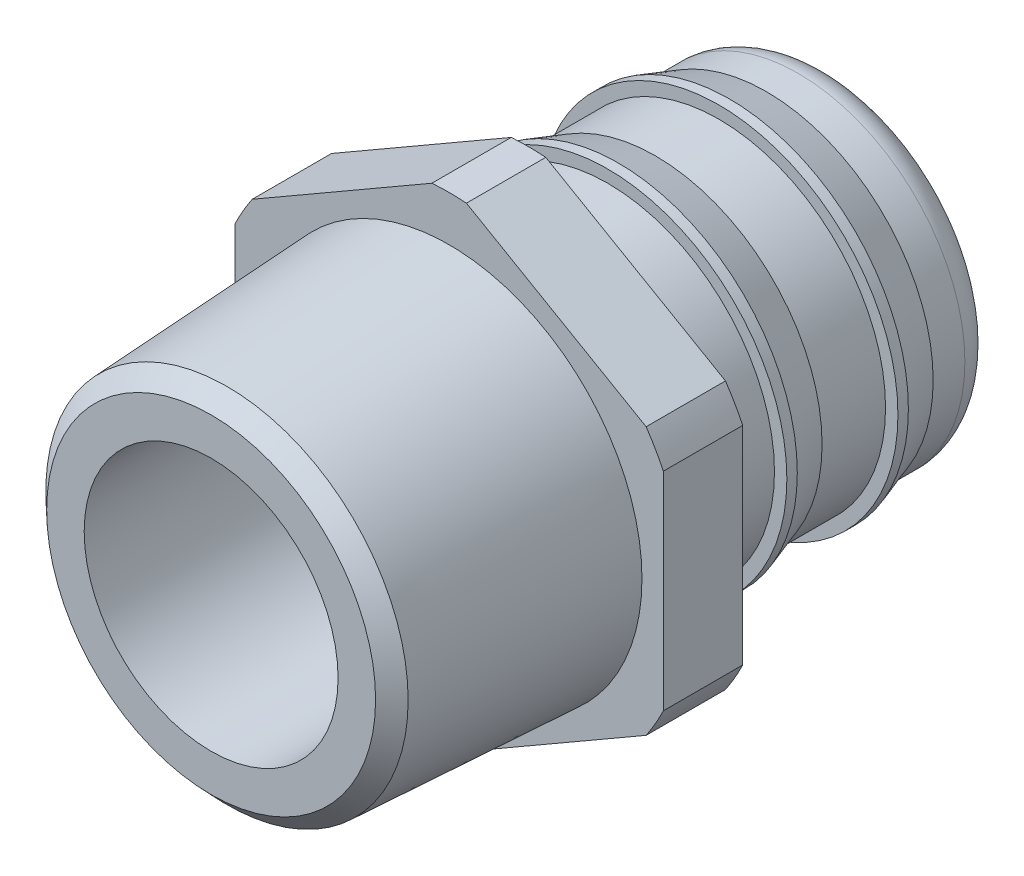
ISO-10303-21;
HEADER;
FILE_DESCRIPTION(('STEP AP214'),'2;1');
FILE_NAME('part.step','',(''),(''),'','','');
FILE_SCHEMA(('AUTOMOTIVE_DESIGN { 1 0 10303 214 1 1 1 1 }'));
ENDSEC;
DATA;
#1=APPLICATION_CONTEXT('core data for automotive mechanical design processes');
#2=APPLICATION_PROTOCOL_DEFINITION('international standard','automotive_design',2000,#1);
#3=PRODUCT_CONTEXT('',#1,'mechanical');
#4=PRODUCT('Part','Part','',(#3));
#5=PRODUCT_RELATED_PRODUCT_CATEGORY('part','',(#4));
#6=PRODUCT_DEFINITION_FORMATION('','',#4);
#7=PRODUCT_DEFINITION_CONTEXT('part definition',#1,'design');
#8=PRODUCT_DEFINITION('design','',#6,#7);
#9=PRODUCT_DEFINITION_SHAPE('','',#8);
#10=(LENGTH_UNIT() NAMED_UNIT(*) SI_UNIT(.MILLI.,.METRE.));
#11=(NAMED_UNIT(*) PLANE_ANGLE_UNIT() SI_UNIT($,.RADIAN.));
#12=(NAMED_UNIT(*) SI_UNIT($,.STERADIAN.) SOLID_ANGLE_UNIT());
#13=UNCERTAINTY_MEASURE_WITH_UNIT(LENGTH_MEASURE(1.E-05),#10,'distance_accuracy_value','');
#14=(GEOMETRIC_REPRESENTATION_CONTEXT(3) GLOBAL_UNCERTAINTY_ASSIGNED_CONTEXT((#13)) GLOBAL_UNIT_ASSIGNED_CONTEXT((#10,
#11,#12)) REPRESENTATION_CONTEXT('',''));
#15=CARTESIAN_POINT('',(0.,0.,0.));
#16=DIRECTION('',(0.,0.,1.));
#17=DIRECTION('',(1.,0.,0.));
#18=AXIS2_PLACEMENT_3D('',#15,#16,#17);
#19=CARTESIAN_POINT('',(0.,0.,0.));
#20=DIRECTION('',(0.,0.,1.));
#21=DIRECTION('',(1.,0.,0.));
#22=AXIS2_PLACEMENT_3D('',#19,#20,#21);
#23=CYLINDRICAL_SURFACE('',#22,15.);
#24=CARTESIAN_POINT('',(0.,0.,-30.));
#25=DIRECTION('',(0.,0.,1.));
#26=DIRECTION('',(1.,0.,0.));
#27=AXIS2_PLACEMENT_3D('',#24,#25,#26);
#28=CIRCLE('',#27,15.);
#29=CARTESIAN_POINT('',(-12.4123758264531,8.42216874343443,-30.));
#30=VERTEX_POINT('',#29);
#31=CARTESIAN_POINT('',(-13.5,6.53834841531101,-30.));
#32=VERTEX_POINT('',#31);
#33=EDGE_CURVE('E133',#30,#32,#28,.T.);
#34=ORIENTED_EDGE('',*,*,#33,.T.);
#35=DIRECTION('',(0.,0.,-1.));
#36=VECTOR('',#35,1.);
#37=CARTESIAN_POINT('',(-13.5,6.53834841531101,-10.));
#38=LINE('',#37,#36);
#39=CARTESIAN_POINT('',(-13.5,6.53834841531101,-25.));
#40=VERTEX_POINT('',#39);
#41=EDGE_CURVE('E118',#40,#32,#38,.T.);
#42=ORIENTED_EDGE('',*,*,#41,.F.);
#43=CARTESIAN_POINT('',(0.,0.,-25.));
#44=DIRECTION('',(0.,0.,1.));
#45=DIRECTION('',(1.,0.,0.));
#46=AXIS2_PLACEMENT_3D('',#43,#44,#45);
#47=CIRCLE('',#46,15.);
#48=CARTESIAN_POINT('',(-12.4123758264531,8.42216874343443,-25.));
#49=VERTEX_POINT('',#48);
#50=EDGE_CURVE('E155',#49,#40,#47,.T.);
#51=ORIENTED_EDGE('',*,*,#50,.F.);
#52=DIRECTION('',(0.,0.,-1.));
#53=VECTOR('',#52,1.);
#54=CARTESIAN_POINT('',(-12.4123758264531,8.42216874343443,-10.));
#55=LINE('',#54,#53);
#56=EDGE_CURVE('E138',#49,#30,#55,.T.);
#57=ORIENTED_EDGE('',*,*,#56,.T.);
#58=EDGE_LOOP('',(#34,#42,#51,#57));
#59=FACE_BOUND('',#58,.T.);
#60=ADVANCED_FACE('F31',(#59),#23,.T.);
#61=CARTESIAN_POINT('',(-13.5,-6.53834841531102,-25.));
#62=VERTEX_POINT('',#61);
#63=CARTESIAN_POINT('',(-12.4123758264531,-8.42216874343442,-25.));
#64=VERTEX_POINT('',#63);
#65=EDGE_CURVE('E156',#62,#64,#47,.T.);
#66=ORIENTED_EDGE('',*,*,#65,.F.);
#67=DIRECTION('',(0.,0.,-1.));
#68=VECTOR('',#67,1.);
#69=CARTESIAN_POINT('',(-13.5,-6.53834841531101,-10.));
#70=LINE('',#69,#68);
#71=CARTESIAN_POINT('',(-13.5,-6.53834841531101,-30.));
#72=VERTEX_POINT('',#71);
#73=EDGE_CURVE('E46',#62,#72,#70,.T.);
#74=ORIENTED_EDGE('',*,*,#73,.T.);
#75=CARTESIAN_POINT('',(-12.4123758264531,-8.42216874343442,-30.));
#76=VERTEX_POINT('',#75);
#77=EDGE_CURVE('E135',#72,#76,#28,.T.);
#78=ORIENTED_EDGE('',*,*,#77,.T.);
#79=DIRECTION('',(0.,0.,-1.));
#80=VECTOR('',#79,1.);
#81=CARTESIAN_POINT('',(-12.4123758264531,-8.42216874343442,-10.));
#82=LINE('',#81,#80);
#83=EDGE_CURVE('E215',#64,#76,#82,.T.);
#84=ORIENTED_EDGE('',*,*,#83,.F.);
#85=EDGE_LOOP('',(#66,#74,#78,#84));
#86=FACE_BOUND('',#85,.T.);
#87=ADVANCED_FACE('F222',(#86),#23,.T.);
#88=CARTESIAN_POINT('',(-1.08762417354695,-14.9605171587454,-25.));
#89=VERTEX_POINT('',#88);
#90=CARTESIAN_POINT('',(1.08762417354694,-14.9605171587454,-25.));
#91=VERTEX_POINT('',#90);
#92=EDGE_CURVE('E163',#89,#91,#47,.T.);
#93=ORIENTED_EDGE('',*,*,#92,.F.);
#94=DIRECTION('',(0.,0.,-1.));
#95=VECTOR('',#94,1.);
#96=CARTESIAN_POINT('',(-1.08762417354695,-14.9605171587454,-10.));
#97=LINE('',#96,#95);
#98=CARTESIAN_POINT('',(-1.08762417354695,-14.9605171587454,-30.));
#99=VERTEX_POINT('',#98);
#100=EDGE_CURVE('E53',#89,#99,#97,.T.);
#101=ORIENTED_EDGE('',*,*,#100,.T.);
#102=CARTESIAN_POINT('',(1.08762417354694,-14.9605171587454,-30.));
#103=VERTEX_POINT('',#102);
#104=EDGE_CURVE('E144',#99,#103,#28,.T.);
#105=ORIENTED_EDGE('',*,*,#104,.T.);
#106=DIRECTION('',(0.,0.,-1.));
#107=VECTOR('',#106,1.);
#108=CARTESIAN_POINT('',(1.08762417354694,-14.9605171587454,-10.));
#109=LINE('',#108,#107);
#110=EDGE_CURVE('E208',#91,#103,#109,.T.);
#111=ORIENTED_EDGE('',*,*,#110,.F.);
#112=EDGE_LOOP('',(#93,#101,#105,#111));
#113=FACE_BOUND('',#112,.T.);
#114=ADVANCED_FACE('F230',(#113),#23,.T.);
#115=CARTESIAN_POINT('',(12.4123758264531,-8.42216874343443,-25.));
#116=VERTEX_POINT('',#115);
#117=CARTESIAN_POINT('',(13.5,-6.53834841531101,-25.));
#118=VERTEX_POINT('',#117);
#119=EDGE_CURVE('E165',#116,#118,#47,.T.);
#120=ORIENTED_EDGE('',*,*,#119,.F.);
#121=DIRECTION('',(0.,0.,-1.));
#122=VECTOR('',#121,1.);
#123=CARTESIAN_POINT('',(12.4123758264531,-8.42216874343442,-10.));
#124=LINE('',#123,#122);
#125=CARTESIAN_POINT('',(12.4123758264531,-8.42216874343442,-30.));
#126=VERTEX_POINT('',#125);
#127=EDGE_CURVE('E207',#116,#126,#124,.T.);
#128=ORIENTED_EDGE('',*,*,#127,.T.);
#129=CARTESIAN_POINT('',(13.5,-6.53834841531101,-30.));
#130=VERTEX_POINT('',#129);
#131=EDGE_CURVE('E147',#126,#130,#28,.T.);
#132=ORIENTED_EDGE('',*,*,#131,.T.);
#133=DIRECTION('',(0.,0.,-1.));
#134=VECTOR('',#133,1.);
#135=CARTESIAN_POINT('',(13.5,-6.53834841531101,-10.));
#136=LINE('',#135,#134);
#137=EDGE_CURVE('E201',#118,#130,#136,.T.);
#138=ORIENTED_EDGE('',*,*,#137,.F.);
#139=EDGE_LOOP('',(#120,#128,#132,#138));
#140=FACE_BOUND('',#139,.T.);
#141=ADVANCED_FACE('F381',(#140),#23,.T.);
#142=CARTESIAN_POINT('',(1.08762417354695,14.9605171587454,-30.));
#143=VERTEX_POINT('',#142);
#144=CARTESIAN_POINT('',(-1.08762417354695,14.9605171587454,-30.));
#145=VERTEX_POINT('',#144);
#146=EDGE_CURVE('E139',#143,#145,#28,.T.);
#147=ORIENTED_EDGE('',*,*,#146,.T.);
#148=DIRECTION('',(0.,0.,-1.));
#149=VECTOR('',#148,1.);
#150=CARTESIAN_POINT('',(-1.08762417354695,14.9605171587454,-10.));
#151=LINE('',#150,#149);
#152=CARTESIAN_POINT('',(-1.08762417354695,14.9605171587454,-25.));
#153=VERTEX_POINT('',#152);
#154=EDGE_CURVE('E195',#153,#145,#151,.T.);
#155=ORIENTED_EDGE('',*,*,#154,.F.);
#156=CARTESIAN_POINT('',(1.08762417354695,14.9605171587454,-25.));
#157=VERTEX_POINT('',#156);
#158=EDGE_CURVE('E148',#157,#153,#47,.T.);
#159=ORIENTED_EDGE('',*,*,#158,.F.);
#160=DIRECTION('',(0.,0.,-1.));
#161=VECTOR('',#160,1.);
#162=CARTESIAN_POINT('',(1.08762417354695,14.9605171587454,-10.));
#163=LINE('',#162,#161);
#164=EDGE_CURVE('E188',#157,#143,#163,.T.);
#165=ORIENTED_EDGE('',*,*,#164,.T.);
#166=EDGE_LOOP('',(#147,#155,#159,#165));
#167=FACE_BOUND('',#166,.T.);
#168=ADVANCED_FACE('F344',(#167),#23,.T.);
#169=CARTESIAN_POINT('',(0.,0.,0.));
#170=DIRECTION('',(0.,0.,1.));
#171=DIRECTION('',(1.,0.,0.));
#172=AXIS2_PLACEMENT_3D('',#169,#170,#171);
#173=CYLINDRICAL_SURFACE('',#172,8.);
#174=CARTESIAN_POINT('',(0.,0.,-49.));
#175=DIRECTION('',(0.,0.,1.));
#176=DIRECTION('',(1.,0.,0.));
#177=AXIS2_PLACEMENT_3D('',#174,#175,#176);
#178=CIRCLE('',#177,8.);
#179=CARTESIAN_POINT('',(8.,0.,-49.));
#180=VERTEX_POINT('',#179);
#181=EDGE_CURVE('E242',#180,#180,#178,.T.);
#182=ORIENTED_EDGE('',*,*,#181,.F.);
#183=EDGE_LOOP('',(#182));
#184=FACE_BOUND('',#183,.T.);
#185=CARTESIAN_POINT('',(0.,0.,-10.));
#186=DIRECTION('',(0.,0.,1.));
#187=DIRECTION('',(1.,0.,0.));
#188=AXIS2_PLACEMENT_3D('',#185,#186,#187);
#189=CIRCLE('',#188,8.);
#190=CARTESIAN_POINT('',(8.,0.,-10.));
#191=VERTEX_POINT('',#190);
#192=EDGE_CURVE('E185',#191,#191,#189,.T.);
#193=ORIENTED_EDGE('',*,*,#192,.T.);
#194=EDGE_LOOP('',(#193));
#195=FACE_BOUND('',#194,.T.);
#196=ADVANCED_FACE('F33',(#184,#195),#173,.F.);
#197=CARTESIAN_POINT('',(0.,8.49999999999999,-49.));
#198=DIRECTION('',(0.,0.,1.));
#199=DIRECTION('',(1.,0.,0.));
#200=AXIS2_PLACEMENT_3D('',#197,#198,#199);
#201=PLANE('',#200);
#202=CARTESIAN_POINT('',(0.,0.,-49.));
#203=DIRECTION('',(0.,0.,1.));
#204=DIRECTION('',(1.,0.,0.));
#205=AXIS2_PLACEMENT_3D('',#202,#203,#204);
#206=CIRCLE('',#205,8.49999999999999);
#207=CARTESIAN_POINT('',(8.49999999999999,0.,-49.));
#208=VERTEX_POINT('',#207);
#209=EDGE_CURVE('E245',#208,#208,#206,.T.);
#210=ORIENTED_EDGE('',*,*,#209,.F.);
#211=EDGE_LOOP('',(#210));
#212=FACE_BOUND('',#211,.T.);
#213=ORIENTED_EDGE('',*,*,#181,.T.);
#214=EDGE_LOOP('',(#213));
#215=FACE_BOUND('',#214,.T.);
#216=ADVANCED_FACE('F334',(#212,#215),#201,.F.);
#217=CARTESIAN_POINT('',(0.,0.,-47.));
#218=DIRECTION('',(0.,0.,1.));
#219=DIRECTION('',(1.,0.,0.));
#220=AXIS2_PLACEMENT_3D('',#217,#218,#219);
#221=TOROIDAL_SURFACE('',#220,8.5,2.);
#222=CARTESIAN_POINT('',(0.,0.,-47.));
#223=DIRECTION('',(0.,0.,1.));
#224=DIRECTION('',(1.,0.,0.));
#225=AXIS2_PLACEMENT_3D('',#222,#223,#224);
#226=CIRCLE('',#225,10.5);
#227=CARTESIAN_POINT('',(10.5,0.,-47.));
#228=VERTEX_POINT('',#227);
#229=EDGE_CURVE('E248',#228,#228,#226,.T.);
#230=ORIENTED_EDGE('',*,*,#229,.F.);
#231=EDGE_LOOP('',(#230));
#232=FACE_BOUND('',#231,.T.);
#233=ORIENTED_EDGE('',*,*,#209,.T.);
#234=EDGE_LOOP('',(#233));
#235=FACE_BOUND('',#234,.T.);
#236=ADVANCED_FACE('F328',(#232,#235),#221,.T.);
#237=CARTESIAN_POINT('',(0.,0.,0.));
#238=DIRECTION('',(0.,0.,1.));
#239=DIRECTION('',(1.,0.,0.));
#240=AXIS2_PLACEMENT_3D('',#237,#238,#239);
#241=CYLINDRICAL_SURFACE('',#240,10.5);
#242=CARTESIAN_POINT('',(0.,0.,-45.00000000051));
#243=DIRECTION('',(0.,0.,1.));
#244=DIRECTION('',(1.,0.,0.));
#245=AXIS2_PLACEMENT_3D('',#242,#243,#244);
#246=CIRCLE('',#245,10.5);
#247=CARTESIAN_POINT('',(10.5,0.,-45.00000000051));
#248=VERTEX_POINT('',#247);
#249=EDGE_CURVE('E251',#248,#248,#246,.T.);
#250=ORIENTED_EDGE('',*,*,#249,.F.);
#251=EDGE_LOOP('',(#250));
#252=FACE_BOUND('',#251,.T.);
#253=ORIENTED_EDGE('',*,*,#229,.T.);
#254=EDGE_LOOP('',(#253));
#255=FACE_BOUND('',#254,.T.);
#256=ADVANCED_FACE('F322',(#252,#255),#241,.T.);
#257=CARTESIAN_POINT('',(0.,0.,-45.00000000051));
#258=DIRECTION('',(0.,0.,1.));
#259=DIRECTION('',(1.,0.,0.));
#260=AXIS2_PLACEMENT_3D('',#257,#258,#259);
#261=CONICAL_SURFACE('',#260,10.5,0.32175055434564);
#262=CARTESIAN_POINT('',(0.,0.,-42.6581138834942));
#263=DIRECTION('',(0.,0.,1.));
#264=DIRECTION('',(1.,0.,0.));
#265=AXIS2_PLACEMENT_3D('',#262,#263,#264);
#266=CIRCLE('',#265,11.2806287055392);
#267=CARTESIAN_POINT('',(11.2806287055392,0.,-42.6581138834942));
#268=VERTEX_POINT('',#267);
#269=EDGE_CURVE('E254',#268,#268,#266,.T.);
#270=ORIENTED_EDGE('',*,*,#269,.F.);
#271=EDGE_LOOP('',(#270));
#272=FACE_BOUND('',#271,.T.);
#273=ORIENTED_EDGE('',*,*,#249,.T.);
#274=EDGE_LOOP('',(#273));
#275=FACE_BOUND('',#274,.T.);
#276=ADVANCED_FACE('F316',(#272,#275),#261,.T.);
#277=CARTESIAN_POINT('',(0.,0.,0.));
#278=DIRECTION('',(0.,0.,1.));
#279=DIRECTION('',(1.,0.,0.));
#280=AXIS2_PLACEMENT_3D('',#277,#278,#279);
#281=CYLINDRICAL_SURFACE('',#280,11.2806287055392);
#282=CARTESIAN_POINT('',(0.,0.,-42.));
#283=DIRECTION('',(0.,0.,1.));
#284=DIRECTION('',(1.,0.,0.));
#285=AXIS2_PLACEMENT_3D('',#282,#283,#284);
#286=CIRCLE('',#285,11.2806287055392);
#287=CARTESIAN_POINT('',(11.2806287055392,0.,-42.));
#288=VERTEX_POINT('',#287);
#289=EDGE_CURVE('E257',#288,#288,#286,.T.);
#290=ORIENTED_EDGE('',*,*,#289,.F.);
#291=EDGE_LOOP('',(#290));
#292=FACE_BOUND('',#291,.T.);
#293=ORIENTED_EDGE('',*,*,#269,.T.);
#294=EDGE_LOOP('',(#293));
#295=FACE_BOUND('',#294,.T.);
#296=ADVANCED_FACE('F310',(#292,#295),#281,.T.);
#297=CARTESIAN_POINT('',(0.,10.5,-42.));
#298=DIRECTION('',(0.,0.,-1.));
#299=DIRECTION('',(-1.,0.,0.));
#300=AXIS2_PLACEMENT_3D('',#297,#298,#299);
#301=PLANE('',#300);
#302=CARTESIAN_POINT('',(0.,0.,-42.));
#303=DIRECTION('',(0.,0.,1.));
#304=DIRECTION('',(1.,0.,0.));
#305=AXIS2_PLACEMENT_3D('',#302,#303,#304);
#306=CIRCLE('',#305,10.5);
#307=CARTESIAN_POINT('',(10.5,0.,-42.));
#308=VERTEX_POINT('',#307);
#309=EDGE_CURVE('E260',#308,#308,#306,.T.);
#310=ORIENTED_EDGE('',*,*,#309,.F.);
#311=EDGE_LOOP('',(#310));
#312=FACE_BOUND('',#311,.T.);
#313=ORIENTED_EDGE('',*,*,#289,.T.);
#314=EDGE_LOOP('',(#313));
#315=FACE_BOUND('',#314,.T.);
#316=ADVANCED_FACE('F304',(#312,#315),#301,.F.);
#317=CARTESIAN_POINT('',(0.,0.,0.));
#318=DIRECTION('',(0.,0.,1.));
#319=DIRECTION('',(1.,0.,0.));
#320=AXIS2_PLACEMENT_3D('',#317,#318,#319);
#321=CYLINDRICAL_SURFACE('',#320,10.5);
#322=CARTESIAN_POINT('',(0.,0.,-38.));
#323=DIRECTION('',(0.,0.,1.));
#324=DIRECTION('',(1.,0.,0.));
#325=AXIS2_PLACEMENT_3D('',#322,#323,#324);
#326=CIRCLE('',#325,10.5);
#327=CARTESIAN_POINT('',(10.5,0.,-38.));
#328=VERTEX_POINT('',#327);
#329=EDGE_CURVE('E263',#328,#328,#326,.T.);
#330=ORIENTED_EDGE('',*,*,#329,.F.);
#331=EDGE_LOOP('',(#330));
#332=FACE_BOUND('',#331,.T.);
#333=ORIENTED_EDGE('',*,*,#309,.T.);
#334=EDGE_LOOP('',(#333));
#335=FACE_BOUND('',#334,.T.);
#336=ADVANCED_FACE('F298',(#332,#335),#321,.T.);
#337=CARTESIAN_POINT('',(0.,0.,-38.));
#338=DIRECTION('',(0.,0.,1.));
#339=DIRECTION('',(1.,0.,0.));
#340=AXIS2_PLACEMENT_3D('',#337,#338,#339);
#341=CONICAL_SURFACE('',#340,10.5,0.321750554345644);
#342=CARTESIAN_POINT('',(0.,0.,-35.6581138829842));
#343=DIRECTION('',(0.,0.,1.));
#344=DIRECTION('',(1.,0.,0.));
#345=AXIS2_PLACEMENT_3D('',#342,#343,#344);
#346=CIRCLE('',#345,11.2806287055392);
#347=CARTESIAN_POINT('',(11.2806287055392,0.,-35.6581138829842));
#348=VERTEX_POINT('',#347);
#349=EDGE_CURVE('E266',#348,#348,#346,.T.);
#350=ORIENTED_EDGE('',*,*,#349,.F.);
#351=EDGE_LOOP('',(#350));
#352=FACE_BOUND('',#351,.T.);
#353=ORIENTED_EDGE('',*,*,#329,.T.);
#354=EDGE_LOOP('',(#353));
#355=FACE_BOUND('',#354,.T.);
#356=ADVANCED_FACE('F292',(#352,#355),#341,.T.);
#357=CARTESIAN_POINT('',(0.,0.,0.));
#358=DIRECTION('',(0.,0.,1.));
#359=DIRECTION('',(1.,0.,0.));
#360=AXIS2_PLACEMENT_3D('',#357,#358,#359);
#361=CYLINDRICAL_SURFACE('',#360,11.2806287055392);
#362=CARTESIAN_POINT('',(0.,0.,-35.));
#363=DIRECTION('',(0.,0.,1.));
#364=DIRECTION('',(1.,0.,0.));
#365=AXIS2_PLACEMENT_3D('',#362,#363,#364);
#366=CIRCLE('',#365,11.2806287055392);
#367=CARTESIAN_POINT('',(11.2806287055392,0.,-35.));
#368=VERTEX_POINT('',#367);
#369=EDGE_CURVE('E269',#368,#368,#366,.T.);
#370=ORIENTED_EDGE('',*,*,#369,.F.);
#371=EDGE_LOOP('',(#370));
#372=FACE_BOUND('',#371,.T.);
#373=ORIENTED_EDGE('',*,*,#349,.T.);
#374=EDGE_LOOP('',(#373));
#375=FACE_BOUND('',#374,.T.);
#376=ADVANCED_FACE('F286',(#372,#375),#361,.T.);
#377=CARTESIAN_POINT('',(0.,10.5,-35.));
#378=DIRECTION('',(0.,0.,-1.));
#379=DIRECTION('',(-1.,0.,0.));
#380=AXIS2_PLACEMENT_3D('',#377,#378,#379);
#381=PLANE('',#380);
#382=CARTESIAN_POINT('',(0.,0.,-35.));
#383=DIRECTION('',(0.,0.,1.));
#384=DIRECTION('',(1.,0.,0.));
#385=AXIS2_PLACEMENT_3D('',#382,#383,#384);
#386=CIRCLE('',#385,10.5);
#387=CARTESIAN_POINT('',(10.5,0.,-35.));
#388=VERTEX_POINT('',#387);
#389=EDGE_CURVE('E272',#388,#388,#386,.T.);
#390=ORIENTED_EDGE('',*,*,#389,.F.);
#391=EDGE_LOOP('',(#390));
#392=FACE_BOUND('',#391,.T.);
#393=ORIENTED_EDGE('',*,*,#369,.T.);
#394=EDGE_LOOP('',(#393));
#395=FACE_BOUND('',#394,.T.);
#396=ADVANCED_FACE('F280',(#392,#395),#381,.F.);
#397=CARTESIAN_POINT('',(0.,0.,0.));
#398=DIRECTION('',(0.,0.,1.));
#399=DIRECTION('',(1.,0.,0.));
#400=AXIS2_PLACEMENT_3D('',#397,#398,#399);
#401=CYLINDRICAL_SURFACE('',#400,10.5);
#402=CARTESIAN_POINT('',(0.,0.,-30.));
#403=DIRECTION('',(0.,0.,1.));
#404=DIRECTION('',(1.,0.,0.));
#405=AXIS2_PLACEMENT_3D('',#402,#403,#404);
#406=CIRCLE('',#405,10.5);
#407=CARTESIAN_POINT('',(10.5,0.,-30.));
#408=VERTEX_POINT('',#407);
#409=EDGE_CURVE('E143',#408,#408,#406,.T.);
#410=ORIENTED_EDGE('',*,*,#409,.F.);
#411=EDGE_LOOP('',(#410));
#412=FACE_BOUND('',#411,.T.);
#413=ORIENTED_EDGE('',*,*,#389,.T.);
#414=EDGE_LOOP('',(#413));
#415=FACE_BOUND('',#414,.T.);
#416=ADVANCED_FACE('F277',(#412,#415),#401,.T.);
#417=CARTESIAN_POINT('',(0.,15.,-30.));
#418=DIRECTION('',(0.,0.,1.));
#419=DIRECTION('',(1.,0.,0.));
#420=AXIS2_PLACEMENT_3D('',#417,#418,#419);
#421=PLANE('',#420);
#422=ORIENTED_EDGE('',*,*,#77,.F.);
#423=DIRECTION('',(0.,-1.,0.));
#424=VECTOR('',#423,1.);
#425=CARTESIAN_POINT('',(-13.5,-6.53834841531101,-30.));
#426=LINE('',#425,#424);
#427=EDGE_CURVE('E121',#32,#72,#426,.T.);
#428=ORIENTED_EDGE('',*,*,#427,.F.);
#429=ORIENTED_EDGE('',*,*,#33,.F.);
#430=DIRECTION('',(-0.866025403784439,-0.5,0.));
#431=VECTOR('',#430,1.);
#432=CARTESIAN_POINT('',(-12.4123758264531,8.42216874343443,-30.));
#433=LINE('',#432,#431);
#434=EDGE_CURVE('E197',#145,#30,#433,.T.);
#435=ORIENTED_EDGE('',*,*,#434,.F.);
#436=ORIENTED_EDGE('',*,*,#146,.F.);
#437=DIRECTION('',(-0.866025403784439,0.5,0.));
#438=VECTOR('',#437,1.);
#439=CARTESIAN_POINT('',(1.08762417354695,14.9605171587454,-30.));
#440=LINE('',#439,#438);
#441=CARTESIAN_POINT('',(12.4123758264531,8.42216874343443,-30.));
#442=VERTEX_POINT('',#441);
#443=EDGE_CURVE('E191',#442,#143,#440,.T.);
#444=ORIENTED_EDGE('',*,*,#443,.F.);
#445=CARTESIAN_POINT('',(13.5,6.53834841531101,-30.));
#446=VERTEX_POINT('',#445);
#447=EDGE_CURVE('E141',#446,#442,#28,.T.);
#448=ORIENTED_EDGE('',*,*,#447,.F.);
#449=DIRECTION('',(0.,1.,0.));
#450=VECTOR('',#449,1.);
#451=CARTESIAN_POINT('',(13.5,6.53834841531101,-30.));
#452=LINE('',#451,#450);
#453=EDGE_CURVE('E204',#130,#446,#452,.T.);
#454=ORIENTED_EDGE('',*,*,#453,.F.);
#455=ORIENTED_EDGE('',*,*,#131,.F.);
#456=DIRECTION('',(0.866025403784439,0.5,0.));
#457=VECTOR('',#456,1.);
#458=CARTESIAN_POINT('',(12.4123758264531,-8.42216874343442,-30.));
#459=LINE('',#458,#457);
#460=EDGE_CURVE('E211',#103,#126,#459,.T.);
#461=ORIENTED_EDGE('',*,*,#460,.F.);
#462=ORIENTED_EDGE('',*,*,#104,.F.);
#463=DIRECTION('',(0.866025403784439,-0.5,0.));
#464=VECTOR('',#463,1.);
#465=CARTESIAN_POINT('',(-1.08762417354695,-14.9605171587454,-30.));
#466=LINE('',#465,#464);
#467=EDGE_CURVE('E218',#76,#99,#466,.T.);
#468=ORIENTED_EDGE('',*,*,#467,.F.);
#469=EDGE_LOOP('',(#422,#428,#429,#435,#436,#444,#448,#454,#455,#461,#462,#468));
#470=FACE_BOUND('',#469,.T.);
#471=ORIENTED_EDGE('',*,*,#409,.T.);
#472=EDGE_LOOP('',(#471));
#473=FACE_BOUND('',#472,.T.);
#474=ADVANCED_FACE('F130',(#470,#473),#421,.F.);
#475=CARTESIAN_POINT('',(13.5,6.53834841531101,-25.));
#476=VERTEX_POINT('',#475);
#477=CARTESIAN_POINT('',(12.4123758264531,8.42216874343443,-25.));
#478=VERTEX_POINT('',#477);
#479=EDGE_CURVE('E161',#476,#478,#47,.T.);
#480=ORIENTED_EDGE('',*,*,#479,.F.);
#481=DIRECTION('',(0.,0.,-1.));
#482=VECTOR('',#481,1.);
#483=CARTESIAN_POINT('',(13.5,6.53834841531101,-10.));
#484=LINE('',#483,#482);
#485=EDGE_CURVE('E200',#476,#446,#484,.T.);
#486=ORIENTED_EDGE('',*,*,#485,.T.);
#487=ORIENTED_EDGE('',*,*,#447,.T.);
#488=DIRECTION('',(0.,0.,-1.));
#489=VECTOR('',#488,1.);
#490=CARTESIAN_POINT('',(12.4123758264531,8.42216874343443,-10.));
#491=LINE('',#490,#489);
#492=EDGE_CURVE('E189',#478,#442,#491,.T.);
#493=ORIENTED_EDGE('',*,*,#492,.F.);
#494=EDGE_LOOP('',(#480,#486,#487,#493));
#495=FACE_BOUND('',#494,.T.);
#496=ADVANCED_FACE('F367',(#495),#23,.T.);
#497=CARTESIAN_POINT('',(0.,12.15,-25.));
#498=DIRECTION('',(0.,0.,-1.));
#499=DIRECTION('',(-1.,0.,0.));
#500=AXIS2_PLACEMENT_3D('',#497,#498,#499);
#501=PLANE('',#500);
#502=CARTESIAN_POINT('',(0.,0.,-25.));
#503=DIRECTION('',(0.,0.,1.));
#504=DIRECTION('',(1.,0.,0.));
#505=AXIS2_PLACEMENT_3D('',#502,#503,#504);
#506=CIRCLE('',#505,12.15);
#507=CARTESIAN_POINT('',(12.15,0.,-25.));
#508=VERTEX_POINT('',#507);
#509=EDGE_CURVE('E172',#508,#508,#506,.T.);
#510=ORIENTED_EDGE('',*,*,#509,.F.);
#511=EDGE_LOOP('',(#510));
#512=FACE_BOUND('',#511,.T.);
#513=ORIENTED_EDGE('',*,*,#50,.T.);
#514=DIRECTION('',(0.,-1.,0.));
#515=VECTOR('',#514,1.);
#516=CARTESIAN_POINT('',(-13.5,12.15,-25.));
#517=LINE('',#516,#515);
#518=EDGE_CURVE('E11',#40,#62,#517,.T.);
#519=ORIENTED_EDGE('',*,*,#518,.T.);
#520=ORIENTED_EDGE('',*,*,#65,.T.);
#521=DIRECTION('',(0.866025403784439,-0.5,0.));
#522=VECTOR('',#521,1.);
#523=CARTESIAN_POINT('',(-12.0111043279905,-8.65384295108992,-25.));
#524=LINE('',#523,#522);
#525=EDGE_CURVE('E39',#64,#89,#524,.T.);
#526=ORIENTED_EDGE('',*,*,#525,.T.);
#527=ORIENTED_EDGE('',*,*,#92,.T.);
#528=DIRECTION('',(0.866025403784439,0.5,0.));
#529=VECTOR('',#528,1.);
#530=CARTESIAN_POINT('',(12.0111043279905,-8.65384295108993,-25.));
#531=LINE('',#530,#529);
#532=EDGE_CURVE('E233',#91,#116,#531,.T.);
#533=ORIENTED_EDGE('',*,*,#532,.T.);
#534=ORIENTED_EDGE('',*,*,#119,.T.);
#535=DIRECTION('',(0.,1.,0.));
#536=VECTOR('',#535,1.);
#537=CARTESIAN_POINT('',(13.5,12.15,-25.));
#538=LINE('',#537,#536);
#539=EDGE_CURVE('E234',#118,#476,#538,.T.);
#540=ORIENTED_EDGE('',*,*,#539,.T.);
#541=ORIENTED_EDGE('',*,*,#479,.T.);
#542=DIRECTION('',(-0.866025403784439,0.5,0.));
#543=VECTOR('',#542,1.);
#544=CARTESIAN_POINT('',(1.48889567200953,14.7288429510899,-25.));
#545=LINE('',#544,#543);
#546=EDGE_CURVE('E240',#478,#157,#545,.T.);
#547=ORIENTED_EDGE('',*,*,#546,.T.);
#548=ORIENTED_EDGE('',*,*,#158,.T.);
#549=DIRECTION('',(-0.866025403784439,-0.5,0.));
#550=VECTOR('',#549,1.);
#551=CARTESIAN_POINT('',(-1.48889567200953,14.7288429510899,-25.));
#552=LINE('',#551,#550);
#553=EDGE_CURVE('E236',#153,#49,#552,.T.);
#554=ORIENTED_EDGE('',*,*,#553,.T.);
#555=EDGE_LOOP('',(#513,#519,#520,#526,#527,#533,#534,#540,#541,#547,#548,#554));
#556=FACE_BOUND('',#555,.T.);
#557=ADVANCED_FACE('F362',(#512,#556),#501,.F.);
#558=CARTESIAN_POINT('',(0.,0.,-25.));
#559=DIRECTION('',(0.,0.,-1.));
#560=DIRECTION('',(-1.,0.,0.));
#561=AXIS2_PLACEMENT_3D('',#558,#559,#560);
#562=CONICAL_SURFACE('',#561,12.15,0.0523598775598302);
#563=CARTESIAN_POINT('',(0.,0.,-10.9986295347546));
#564=DIRECTION('',(0.,0.,1.));
#565=DIRECTION('',(1.,0.,0.));
#566=AXIS2_PLACEMENT_3D('',#563,#564,#565);
#567=CIRCLE('',#566,11.4162192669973);
#568=CARTESIAN_POINT('',(11.4162192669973,0.,-10.9986295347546));
#569=VERTEX_POINT('',#568);
#570=EDGE_CURVE('E176',#569,#569,#567,.T.);
#571=ORIENTED_EDGE('',*,*,#570,.F.);
#572=EDGE_LOOP('',(#571));
#573=FACE_BOUND('',#572,.T.);
#574=ORIENTED_EDGE('',*,*,#509,.T.);
#575=EDGE_LOOP('',(#574));
#576=FACE_BOUND('',#575,.T.);
#577=ADVANCED_FACE('F357',(#573,#576),#562,.T.);
#578=CARTESIAN_POINT('',(0.,0.,-10.9986295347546));
#579=DIRECTION('',(0.,0.,-1.));
#580=DIRECTION('',(-1.,0.,0.));
#581=AXIS2_PLACEMENT_3D('',#578,#579,#580);
#582=CONICAL_SURFACE('',#581,11.4162192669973,0.811578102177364);
#583=CARTESIAN_POINT('',(0.,0.,-10.));
#584=DIRECTION('',(0.,0.,1.));
#585=DIRECTION('',(1.,0.,0.));
#586=AXIS2_PLACEMENT_3D('',#583,#584,#585);
#587=CIRCLE('',#586,10.3638833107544);
#588=CARTESIAN_POINT('',(10.3638833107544,0.,-10.));
#589=VERTEX_POINT('',#588);
#590=EDGE_CURVE('E180',#589,#589,#587,.T.);
#591=ORIENTED_EDGE('',*,*,#590,.F.);
#592=EDGE_LOOP('',(#591));
#593=FACE_BOUND('',#592,.T.);
#594=ORIENTED_EDGE('',*,*,#570,.T.);
#595=EDGE_LOOP('',(#594));
#596=FACE_BOUND('',#595,.T.);
#597=ADVANCED_FACE('F351',(#593,#596),#582,.T.);
#598=CARTESIAN_POINT('',(0.,8.,-10.));
#599=DIRECTION('',(0.,0.,-1.));
#600=DIRECTION('',(-1.,0.,0.));
#601=AXIS2_PLACEMENT_3D('',#598,#599,#600);
#602=PLANE('',#601);
#603=ORIENTED_EDGE('',*,*,#192,.F.);
#604=EDGE_LOOP('',(#603));
#605=FACE_BOUND('',#604,.T.);
#606=ORIENTED_EDGE('',*,*,#590,.T.);
#607=EDGE_LOOP('',(#606));
#608=FACE_BOUND('',#607,.T.);
#609=ADVANCED_FACE('F347',(#605,#608),#602,.F.);
#610=CARTESIAN_POINT('',(1.08762417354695,14.9605171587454,-10.));
#611=DIRECTION('',(-0.5,-0.866025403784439,0.));
#612=DIRECTION('',(0.866025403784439,-0.5,0.));
#613=AXIS2_PLACEMENT_3D('',#610,#611,#612);
#614=PLANE('',#613);
#615=ORIENTED_EDGE('',*,*,#492,.T.);
#616=ORIENTED_EDGE('',*,*,#443,.T.);
#617=ORIENTED_EDGE('',*,*,#164,.F.);
#618=ORIENTED_EDGE('',*,*,#546,.F.);
#619=EDGE_LOOP('',(#615,#616,#617,#618));
#620=FACE_BOUND('',#619,.T.);
#621=ADVANCED_FACE('F350',(#620),#614,.F.);
#622=CARTESIAN_POINT('',(-12.4123758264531,8.42216874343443,-10.));
#623=DIRECTION('',(0.5,-0.866025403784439,0.));
#624=DIRECTION('',(0.866025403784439,0.5,0.));
#625=AXIS2_PLACEMENT_3D('',#622,#623,#624);
#626=PLANE('',#625);
#627=ORIENTED_EDGE('',*,*,#154,.T.);
#628=ORIENTED_EDGE('',*,*,#434,.T.);
#629=ORIENTED_EDGE('',*,*,#56,.F.);
#630=ORIENTED_EDGE('',*,*,#553,.F.);
#631=EDGE_LOOP('',(#627,#628,#629,#630));
#632=FACE_BOUND('',#631,.T.);
#633=ADVANCED_FACE('F391',(#632),#626,.F.);
#634=CARTESIAN_POINT('',(13.5,6.53834841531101,-10.));
#635=DIRECTION('',(-1.,0.,0.));
#636=DIRECTION('',(0.,0.,1.));
#637=AXIS2_PLACEMENT_3D('',#634,#635,#636);
#638=PLANE('',#637);
#639=ORIENTED_EDGE('',*,*,#137,.T.);
#640=ORIENTED_EDGE('',*,*,#453,.T.);
#641=ORIENTED_EDGE('',*,*,#485,.F.);
#642=ORIENTED_EDGE('',*,*,#539,.F.);
#643=EDGE_LOOP('',(#639,#640,#641,#642));
#644=FACE_BOUND('',#643,.T.);
#645=ADVANCED_FACE('F393',(#644),#638,.F.);
#646=CARTESIAN_POINT('',(12.4123758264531,-8.42216874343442,-10.));
#647=DIRECTION('',(-0.5,0.866025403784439,0.));
#648=DIRECTION('',(-0.866025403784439,-0.5,0.));
#649=AXIS2_PLACEMENT_3D('',#646,#647,#648);
#650=PLANE('',#649);
#651=ORIENTED_EDGE('',*,*,#110,.T.);
#652=ORIENTED_EDGE('',*,*,#460,.T.);
#653=ORIENTED_EDGE('',*,*,#127,.F.);
#654=ORIENTED_EDGE('',*,*,#532,.F.);
#655=EDGE_LOOP('',(#651,#652,#653,#654));
#656=FACE_BOUND('',#655,.T.);
#657=ADVANCED_FACE('F232',(#656),#650,.F.);
#658=CARTESIAN_POINT('',(-1.08762417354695,-14.9605171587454,-10.));
#659=DIRECTION('',(0.5,0.866025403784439,0.));
#660=DIRECTION('',(-0.866025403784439,0.5,0.));
#661=AXIS2_PLACEMENT_3D('',#658,#659,#660);
#662=PLANE('',#661);
#663=ORIENTED_EDGE('',*,*,#83,.T.);
#664=ORIENTED_EDGE('',*,*,#467,.T.);
#665=ORIENTED_EDGE('',*,*,#100,.F.);
#666=ORIENTED_EDGE('',*,*,#525,.F.);
#667=EDGE_LOOP('',(#663,#664,#665,#666));
#668=FACE_BOUND('',#667,.T.);
#669=ADVANCED_FACE('F224',(#668),#662,.F.);
#670=CARTESIAN_POINT('',(-13.5,-6.53834841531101,-10.));
#671=DIRECTION('',(1.,0.,0.));
#672=DIRECTION('',(0.,1.,0.));
#673=AXIS2_PLACEMENT_3D('',#670,#671,#672);
#674=PLANE('',#673);
#675=ORIENTED_EDGE('',*,*,#41,.T.);
#676=ORIENTED_EDGE('',*,*,#427,.T.);
#677=ORIENTED_EDGE('',*,*,#73,.F.);
#678=ORIENTED_EDGE('',*,*,#518,.F.);
#679=EDGE_LOOP('',(#675,#676,#677,#678));
#680=FACE_BOUND('',#679,.T.);
#681=ADVANCED_FACE('F120',(#680),#674,.F.);
#682=CLOSED_SHELL('',(#60,#87,#114,#141,#168,#196,#216,#236,#256,#276,#296,#316,#336,#356,#376,
#396,#416,#474,#496,#557,#577,#597,#609,#621,#633,#645,#657,#669,#681));
#683=MANIFOLD_SOLID_BREP('B2',#682);
#684=ADVANCED_BREP_SHAPE_REPRESENTATION('',(#18,#683),#14);
#685=SHAPE_DEFINITION_REPRESENTATION(#9,#684);
ENDSEC;
END-ISO-10303-21;
